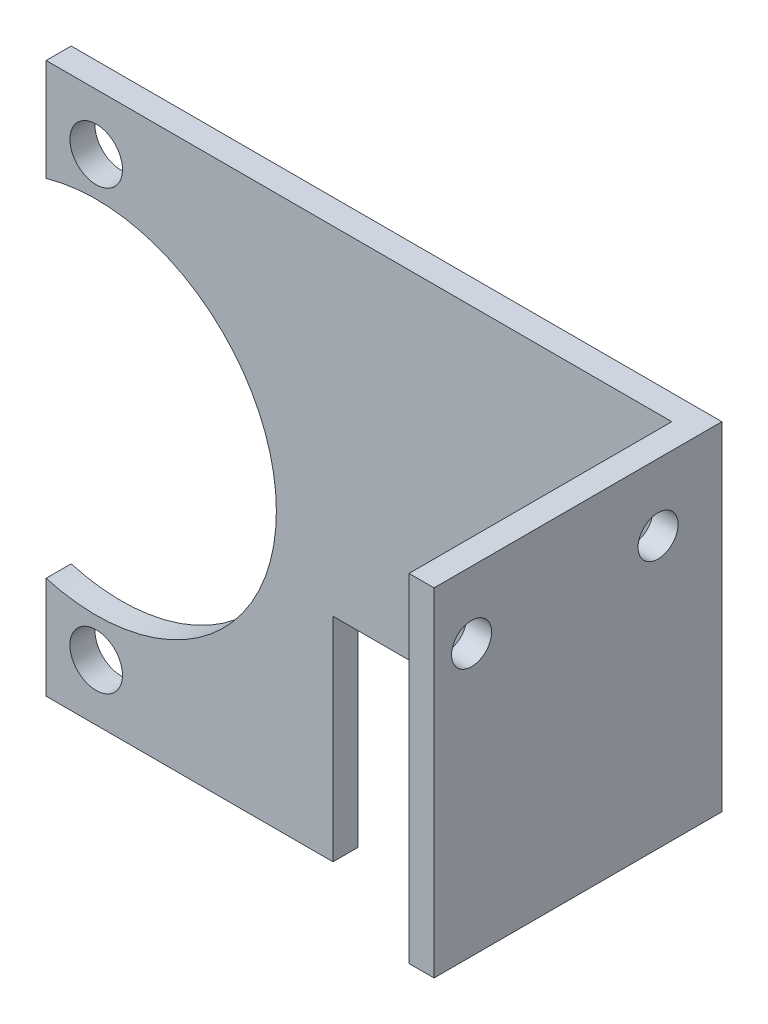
ISO-10303-21;
HEADER;
FILE_DESCRIPTION(('STEP AP214'),'2;1');
FILE_NAME('part.step','',(''),(''),'','','');
FILE_SCHEMA(('AUTOMOTIVE_DESIGN { 1 0 10303 214 1 1 1 1 }'));
ENDSEC;
DATA;
#1=APPLICATION_CONTEXT('core data for automotive mechanical design processes');
#2=APPLICATION_PROTOCOL_DEFINITION('international standard','automotive_design',2000,#1);
#3=PRODUCT_CONTEXT('',#1,'mechanical');
#4=PRODUCT('Part','Part','',(#3));
#5=PRODUCT_RELATED_PRODUCT_CATEGORY('part','',(#4));
#6=PRODUCT_DEFINITION_FORMATION('','',#4);
#7=PRODUCT_DEFINITION_CONTEXT('part definition',#1,'design');
#8=PRODUCT_DEFINITION('design','',#6,#7);
#9=PRODUCT_DEFINITION_SHAPE('','',#8);
#10=(LENGTH_UNIT() NAMED_UNIT(*) SI_UNIT(.MILLI.,.METRE.));
#11=(NAMED_UNIT(*) PLANE_ANGLE_UNIT() SI_UNIT($,.RADIAN.));
#12=(NAMED_UNIT(*) SI_UNIT($,.STERADIAN.) SOLID_ANGLE_UNIT());
#13=UNCERTAINTY_MEASURE_WITH_UNIT(LENGTH_MEASURE(1.E-05),#10,'distance_accuracy_value','');
#14=(GEOMETRIC_REPRESENTATION_CONTEXT(3) GLOBAL_UNCERTAINTY_ASSIGNED_CONTEXT((#13)) GLOBAL_UNIT_ASSIGNED_CONTEXT((#10,
#11,#12)) REPRESENTATION_CONTEXT('',''));
#15=CARTESIAN_POINT('',(0.,0.,0.));
#16=DIRECTION('',(0.,0.,1.));
#17=DIRECTION('',(1.,0.,0.));
#18=AXIS2_PLACEMENT_3D('',#15,#16,#17);
#19=CARTESIAN_POINT('',(0.,0.,2.));
#20=DIRECTION('',(0.,0.,1.));
#21=DIRECTION('',(1.,0.,0.));
#22=AXIS2_PLACEMENT_3D('',#19,#20,#21);
#23=PLANE('',#22);
#24=CARTESIAN_POINT('',(-30.5,17.5,2.));
#25=DIRECTION('',(0.,0.,1.));
#26=DIRECTION('',(1.,0.,0.));
#27=AXIS2_PLACEMENT_3D('',#24,#25,#26);
#28=CIRCLE('',#27,2.1);
#29=CARTESIAN_POINT('',(-28.4,17.5,2.));
#30=VERTEX_POINT('',#29);
#31=EDGE_CURVE('E166',#30,#30,#28,.T.);
#32=ORIENTED_EDGE('',*,*,#31,.F.);
#33=EDGE_LOOP('',(#32));
#34=FACE_BOUND('',#33,.T.);
#35=CARTESIAN_POINT('',(-30.5,-17.5,2.));
#36=DIRECTION('',(0.,0.,1.));
#37=DIRECTION('',(1.,0.,0.));
#38=AXIS2_PLACEMENT_3D('',#35,#36,#37);
#39=CIRCLE('',#38,2.1);
#40=CARTESIAN_POINT('',(-28.4,-17.5,2.));
#41=VERTEX_POINT('',#40);
#42=EDGE_CURVE('E207',#41,#41,#39,.T.);
#43=ORIENTED_EDGE('',*,*,#42,.F.);
#44=EDGE_LOOP('',(#43));
#45=FACE_BOUND('',#44,.T.);
#46=DIRECTION('',(-1.,0.,0.));
#47=VECTOR('',#46,1.);
#48=CARTESIAN_POINT('',(0.,-5.,2.));
#49=LINE('',#48,#47);
#50=CARTESIAN_POINT('',(15.5,-5.,2.));
#51=VERTEX_POINT('',#50);
#52=CARTESIAN_POINT('',(-11.5776673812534,-5.,2.));
#53=VERTEX_POINT('',#52);
#54=EDGE_CURVE('E136',#51,#53,#49,.T.);
#55=ORIENTED_EDGE('',*,*,#54,.F.);
#56=DIRECTION('',(0.,1.,0.));
#57=VECTOR('',#56,1.);
#58=CARTESIAN_POINT('',(15.5,0.,2.));
#59=LINE('',#58,#57);
#60=CARTESIAN_POINT('',(15.5,22.,2.));
#61=VERTEX_POINT('',#60);
#62=EDGE_CURVE('E147',#51,#61,#59,.T.);
#63=ORIENTED_EDGE('',*,*,#62,.T.);
#64=DIRECTION('',(-1.,0.,0.));
#65=VECTOR('',#64,1.);
#66=CARTESIAN_POINT('',(0.,22.,2.));
#67=LINE('',#66,#65);
#68=CARTESIAN_POINT('',(-34.5,22.,2.));
#69=VERTEX_POINT('',#68);
#70=EDGE_CURVE('E61',#61,#69,#67,.T.);
#71=ORIENTED_EDGE('',*,*,#70,.T.);
#72=DIRECTION('',(0.,-1.,0.));
#73=VECTOR('',#72,1.);
#74=CARTESIAN_POINT('',(-34.5,0.,2.));
#75=LINE('',#74,#73);
#76=CARTESIAN_POINT('',(-34.5,13.8332931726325,2.));
#77=VERTEX_POINT('',#76);
#78=EDGE_CURVE('E210',#69,#77,#75,.T.);
#79=ORIENTED_EDGE('',*,*,#78,.T.);
#80=CARTESIAN_POINT('',(-30.5,0.,2.));
#81=DIRECTION('',(0.,0.,1.));
#82=DIRECTION('',(1.,0.,0.));
#83=AXIS2_PLACEMENT_3D('',#80,#81,#82);
#84=CIRCLE('',#83,14.4);
#85=CARTESIAN_POINT('',(-34.5,-13.8332931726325,2.));
#86=VERTEX_POINT('',#85);
#87=EDGE_CURVE('E101',#77,#86,#84,.F.);
#88=ORIENTED_EDGE('',*,*,#87,.T.);
#89=DIRECTION('',(0.,-1.,0.));
#90=VECTOR('',#89,1.);
#91=CARTESIAN_POINT('',(-34.5,0.,2.));
#92=LINE('',#91,#90);
#93=CARTESIAN_POINT('',(-34.5,-22.,2.));
#94=VERTEX_POINT('',#93);
#95=EDGE_CURVE('E117',#86,#94,#92,.T.);
#96=ORIENTED_EDGE('',*,*,#95,.T.);
#97=DIRECTION('',(1.,0.,0.));
#98=VECTOR('',#97,1.);
#99=CARTESIAN_POINT('',(0.,-22.,2.));
#100=LINE('',#99,#98);
#101=CARTESIAN_POINT('',(-11.5776673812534,-22.,2.));
#102=VERTEX_POINT('',#101);
#103=EDGE_CURVE('E111',#94,#102,#100,.T.);
#104=ORIENTED_EDGE('',*,*,#103,.T.);
#105=DIRECTION('',(0.,-1.,0.));
#106=VECTOR('',#105,1.);
#107=CARTESIAN_POINT('',(-11.5776673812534,0.,2.));
#108=LINE('',#107,#106);
#109=EDGE_CURVE('E115',#53,#102,#108,.T.);
#110=ORIENTED_EDGE('',*,*,#109,.F.);
#111=EDGE_LOOP('',(#55,#63,#71,#79,#88,#96,#104,#110));
#112=FACE_BOUND('',#111,.T.);
#113=ADVANCED_FACE('F35',(#34,#45,#112),#23,.T.);
#114=CARTESIAN_POINT('',(-34.5,0.,2.));
#115=DIRECTION('',(1.,0.,0.));
#116=DIRECTION('',(0.,0.,-1.));
#117=AXIS2_PLACEMENT_3D('',#114,#115,#116);
#118=PLANE('',#117);
#119=DIRECTION('',(0.,-1.,0.));
#120=VECTOR('',#119,1.);
#121=CARTESIAN_POINT('',(-34.5,0.,0.));
#122=LINE('',#121,#120);
#123=CARTESIAN_POINT('',(-34.5,22.,0.));
#124=VERTEX_POINT('',#123);
#125=CARTESIAN_POINT('',(-34.5,13.8332931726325,0.));
#126=VERTEX_POINT('',#125);
#127=EDGE_CURVE('E150',#124,#126,#122,.T.);
#128=ORIENTED_EDGE('',*,*,#127,.T.);
#129=DIRECTION('',(0.,0.,-1.));
#130=VECTOR('',#129,1.);
#131=CARTESIAN_POINT('',(-34.5,13.8332931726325,2.));
#132=LINE('',#131,#130);
#133=EDGE_CURVE('E11',#77,#126,#132,.T.);
#134=ORIENTED_EDGE('',*,*,#133,.F.);
#135=ORIENTED_EDGE('',*,*,#78,.F.);
#136=DIRECTION('',(0.,0.,-1.));
#137=VECTOR('',#136,1.);
#138=CARTESIAN_POINT('',(-34.5,22.,2.));
#139=LINE('',#138,#137);
#140=EDGE_CURVE('E142',#69,#124,#139,.T.);
#141=ORIENTED_EDGE('',*,*,#140,.T.);
#142=EDGE_LOOP('',(#128,#134,#135,#141));
#143=FACE_BOUND('',#142,.T.);
#144=ADVANCED_FACE('F233',(#143),#118,.F.);
#145=CARTESIAN_POINT('',(-30.5,0.,2.));
#146=DIRECTION('',(0.,0.,-1.));
#147=DIRECTION('',(-1.,0.,0.));
#148=AXIS2_PLACEMENT_3D('',#145,#146,#147);
#149=CYLINDRICAL_SURFACE('',#148,14.4);
#150=CARTESIAN_POINT('',(-30.5,0.,0.));
#151=DIRECTION('',(0.,0.,1.));
#152=DIRECTION('',(1.,0.,0.));
#153=AXIS2_PLACEMENT_3D('',#150,#151,#152);
#154=CIRCLE('',#153,14.4);
#155=CARTESIAN_POINT('',(-34.5,-13.8332931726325,0.));
#156=VERTEX_POINT('',#155);
#157=EDGE_CURVE('E153',#126,#156,#154,.F.);
#158=ORIENTED_EDGE('',*,*,#157,.T.);
#159=DIRECTION('',(0.,0.,-1.));
#160=VECTOR('',#159,1.);
#161=CARTESIAN_POINT('',(-34.5,-13.8332931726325,2.));
#162=LINE('',#161,#160);
#163=EDGE_CURVE('E44',#86,#156,#162,.T.);
#164=ORIENTED_EDGE('',*,*,#163,.F.);
#165=ORIENTED_EDGE('',*,*,#87,.F.);
#166=ORIENTED_EDGE('',*,*,#133,.T.);
#167=EDGE_LOOP('',(#158,#164,#165,#166));
#168=FACE_BOUND('',#167,.T.);
#169=ADVANCED_FACE('F214',(#168),#149,.F.);
#170=CARTESIAN_POINT('',(-34.5,0.,2.));
#171=DIRECTION('',(1.,0.,0.));
#172=DIRECTION('',(0.,0.,-1.));
#173=AXIS2_PLACEMENT_3D('',#170,#171,#172);
#174=PLANE('',#173);
#175=DIRECTION('',(0.,-1.,0.));
#176=VECTOR('',#175,1.);
#177=CARTESIAN_POINT('',(-34.5,0.,0.));
#178=LINE('',#177,#176);
#179=CARTESIAN_POINT('',(-34.5,-22.,0.));
#180=VERTEX_POINT('',#179);
#181=EDGE_CURVE('E155',#156,#180,#178,.T.);
#182=ORIENTED_EDGE('',*,*,#181,.T.);
#183=DIRECTION('',(0.,0.,-1.));
#184=VECTOR('',#183,1.);
#185=CARTESIAN_POINT('',(-34.5,-22.,2.));
#186=LINE('',#185,#184);
#187=EDGE_CURVE('E130',#94,#180,#186,.T.);
#188=ORIENTED_EDGE('',*,*,#187,.F.);
#189=ORIENTED_EDGE('',*,*,#95,.F.);
#190=ORIENTED_EDGE('',*,*,#163,.T.);
#191=EDGE_LOOP('',(#182,#188,#189,#190));
#192=FACE_BOUND('',#191,.T.);
#193=ADVANCED_FACE('F217',(#192),#174,.F.);
#194=CARTESIAN_POINT('',(0.,-22.,2.));
#195=DIRECTION('',(0.,1.,0.));
#196=DIRECTION('',(-1.,0.,0.));
#197=AXIS2_PLACEMENT_3D('',#194,#195,#196);
#198=PLANE('',#197);
#199=DIRECTION('',(1.,0.,0.));
#200=VECTOR('',#199,1.);
#201=CARTESIAN_POINT('',(0.,-22.,0.));
#202=LINE('',#201,#200);
#203=CARTESIAN_POINT('',(-11.5776673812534,-22.,0.));
#204=VERTEX_POINT('',#203);
#205=EDGE_CURVE('E126',#180,#204,#202,.T.);
#206=ORIENTED_EDGE('',*,*,#205,.T.);
#207=DIRECTION('',(0.,0.,-1.));
#208=VECTOR('',#207,1.);
#209=CARTESIAN_POINT('',(-11.5776673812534,-22.,2.));
#210=LINE('',#209,#208);
#211=EDGE_CURVE('E123',#102,#204,#210,.T.);
#212=ORIENTED_EDGE('',*,*,#211,.F.);
#213=ORIENTED_EDGE('',*,*,#103,.F.);
#214=ORIENTED_EDGE('',*,*,#187,.T.);
#215=EDGE_LOOP('',(#206,#212,#213,#214));
#216=FACE_BOUND('',#215,.T.);
#217=ADVANCED_FACE('F124',(#216),#198,.F.);
#218=CARTESIAN_POINT('',(-11.5776673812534,0.,2.));
#219=DIRECTION('',(1.,0.,0.));
#220=DIRECTION('',(0.,1.,0.));
#221=AXIS2_PLACEMENT_3D('',#218,#219,#220);
#222=PLANE('',#221);
#223=DIRECTION('',(0.,-1.,0.));
#224=VECTOR('',#223,1.);
#225=CARTESIAN_POINT('',(-11.5776673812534,0.,0.));
#226=LINE('',#225,#224);
#227=CARTESIAN_POINT('',(-11.5776673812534,-5.,0.));
#228=VERTEX_POINT('',#227);
#229=EDGE_CURVE('E158',#228,#204,#226,.T.);
#230=ORIENTED_EDGE('',*,*,#229,.F.);
#231=DIRECTION('',(0.,0.,-1.));
#232=VECTOR('',#231,1.);
#233=CARTESIAN_POINT('',(-11.5776673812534,-5.,2.));
#234=LINE('',#233,#232);
#235=EDGE_CURVE('E131',#53,#228,#234,.T.);
#236=ORIENTED_EDGE('',*,*,#235,.F.);
#237=ORIENTED_EDGE('',*,*,#109,.T.);
#238=ORIENTED_EDGE('',*,*,#211,.T.);
#239=EDGE_LOOP('',(#230,#236,#237,#238));
#240=FACE_BOUND('',#239,.T.);
#241=ADVANCED_FACE('F134',(#240),#222,.T.);
#242=CARTESIAN_POINT('',(0.,-5.,2.));
#243=DIRECTION('',(0.,-1.,0.));
#244=DIRECTION('',(1.,0.,0.));
#245=AXIS2_PLACEMENT_3D('',#242,#243,#244);
#246=PLANE('',#245);
#247=DIRECTION('',(0.,0.,-1.));
#248=VECTOR('',#247,1.);
#249=CARTESIAN_POINT('',(15.5,-5.,23.));
#250=LINE('',#249,#248);
#251=CARTESIAN_POINT('',(15.5,-5.,23.));
#252=VERTEX_POINT('',#251);
#253=EDGE_CURVE('E52',#252,#51,#250,.T.);
#254=ORIENTED_EDGE('',*,*,#253,.T.);
#255=ORIENTED_EDGE('',*,*,#54,.T.);
#256=ORIENTED_EDGE('',*,*,#235,.T.);
#257=DIRECTION('',(-1.,0.,0.));
#258=VECTOR('',#257,1.);
#259=CARTESIAN_POINT('',(0.,-5.,0.));
#260=LINE('',#259,#258);
#261=CARTESIAN_POINT('',(17.5,-5.,0.));
#262=VERTEX_POINT('',#261);
#263=EDGE_CURVE('E160',#262,#228,#260,.T.);
#264=ORIENTED_EDGE('',*,*,#263,.F.);
#265=DIRECTION('',(0.,0.,-1.));
#266=VECTOR('',#265,1.);
#267=CARTESIAN_POINT('',(17.5,-5.,2.));
#268=LINE('',#267,#266);
#269=CARTESIAN_POINT('',(17.5,-5.,23.));
#270=VERTEX_POINT('',#269);
#271=EDGE_CURVE('E170',#270,#262,#268,.T.);
#272=ORIENTED_EDGE('',*,*,#271,.F.);
#273=DIRECTION('',(1.,0.,0.));
#274=VECTOR('',#273,1.);
#275=CARTESIAN_POINT('',(0.,-5.,23.));
#276=LINE('',#275,#274);
#277=EDGE_CURVE('E197',#252,#270,#276,.T.);
#278=ORIENTED_EDGE('',*,*,#277,.F.);
#279=EDGE_LOOP('',(#254,#255,#256,#264,#272,#278));
#280=FACE_BOUND('',#279,.T.);
#281=ADVANCED_FACE('F224',(#280),#246,.T.);
#282=CARTESIAN_POINT('',(17.5,0.,2.));
#283=DIRECTION('',(1.,0.,0.));
#284=DIRECTION('',(0.,1.,0.));
#285=AXIS2_PLACEMENT_3D('',#282,#283,#284);
#286=PLANE('',#285);
#287=CARTESIAN_POINT('',(17.5,16.65,5.1));
#288=DIRECTION('',(1.,0.,0.));
#289=DIRECTION('',(0.,0.,-1.));
#290=AXIS2_PLACEMENT_3D('',#287,#288,#289);
#291=CIRCLE('',#290,1.6);
#292=CARTESIAN_POINT('',(17.5,16.65,3.5));
#293=VERTEX_POINT('',#292);
#294=EDGE_CURVE('E189',#293,#293,#291,.T.);
#295=ORIENTED_EDGE('',*,*,#294,.F.);
#296=EDGE_LOOP('',(#295));
#297=FACE_BOUND('',#296,.T.);
#298=CARTESIAN_POINT('',(17.5,16.65,20.));
#299=DIRECTION('',(1.,0.,0.));
#300=DIRECTION('',(0.,0.,-1.));
#301=AXIS2_PLACEMENT_3D('',#298,#299,#300);
#302=CIRCLE('',#301,1.6);
#303=CARTESIAN_POINT('',(17.5,16.65,18.4));
#304=VERTEX_POINT('',#303);
#305=EDGE_CURVE('E178',#304,#304,#302,.T.);
#306=ORIENTED_EDGE('',*,*,#305,.F.);
#307=EDGE_LOOP('',(#306));
#308=FACE_BOUND('',#307,.T.);
#309=DIRECTION('',(0.,-1.,0.));
#310=VECTOR('',#309,1.);
#311=CARTESIAN_POINT('',(17.5,0.,0.));
#312=LINE('',#311,#310);
#313=CARTESIAN_POINT('',(17.5,22.,0.));
#314=VERTEX_POINT('',#313);
#315=EDGE_CURVE('E162',#314,#262,#312,.T.);
#316=ORIENTED_EDGE('',*,*,#315,.F.);
#317=DIRECTION('',(0.,0.,-1.));
#318=VECTOR('',#317,1.);
#319=CARTESIAN_POINT('',(17.5,22.,2.));
#320=LINE('',#319,#318);
#321=CARTESIAN_POINT('',(17.5,22.,23.));
#322=VERTEX_POINT('',#321);
#323=EDGE_CURVE('E168',#322,#314,#320,.T.);
#324=ORIENTED_EDGE('',*,*,#323,.F.);
#325=DIRECTION('',(0.,-1.,0.));
#326=VECTOR('',#325,1.);
#327=CARTESIAN_POINT('',(17.5,0.,23.));
#328=LINE('',#327,#326);
#329=EDGE_CURVE('E177',#322,#270,#328,.T.);
#330=ORIENTED_EDGE('',*,*,#329,.T.);
#331=ORIENTED_EDGE('',*,*,#271,.T.);
#332=EDGE_LOOP('',(#316,#324,#330,#331));
#333=FACE_BOUND('',#332,.T.);
#334=ADVANCED_FACE('F236',(#297,#308,#333),#286,.T.);
#335=CARTESIAN_POINT('',(-30.5,-17.5,2.));
#336=DIRECTION('',(0.,0.,-1.));
#337=DIRECTION('',(-1.,0.,0.));
#338=AXIS2_PLACEMENT_3D('',#335,#336,#337);
#339=CYLINDRICAL_SURFACE('',#338,2.1);
#340=ORIENTED_EDGE('',*,*,#42,.T.);
#341=EDGE_LOOP('',(#340));
#342=FACE_BOUND('',#341,.T.);
#343=CARTESIAN_POINT('',(-30.5,-17.5,0.));
#344=DIRECTION('',(0.,0.,1.));
#345=DIRECTION('',(1.,0.,0.));
#346=AXIS2_PLACEMENT_3D('',#343,#344,#345);
#347=CIRCLE('',#346,2.1);
#348=CARTESIAN_POINT('',(-28.4,-17.5,0.));
#349=VERTEX_POINT('',#348);
#350=EDGE_CURVE('E146',#349,#349,#347,.T.);
#351=ORIENTED_EDGE('',*,*,#350,.F.);
#352=EDGE_LOOP('',(#351));
#353=FACE_BOUND('',#352,.T.);
#354=ADVANCED_FACE('F271',(#342,#353),#339,.F.);
#355=CARTESIAN_POINT('',(-30.5,17.5,2.));
#356=DIRECTION('',(0.,0.,-1.));
#357=DIRECTION('',(-1.,0.,0.));
#358=AXIS2_PLACEMENT_3D('',#355,#356,#357);
#359=CYLINDRICAL_SURFACE('',#358,2.1);
#360=ORIENTED_EDGE('',*,*,#31,.T.);
#361=EDGE_LOOP('',(#360));
#362=FACE_BOUND('',#361,.T.);
#363=CARTESIAN_POINT('',(-30.5,17.5,0.));
#364=DIRECTION('',(0.,0.,1.));
#365=DIRECTION('',(1.,0.,0.));
#366=AXIS2_PLACEMENT_3D('',#363,#364,#365);
#367=CIRCLE('',#366,2.1);
#368=CARTESIAN_POINT('',(-28.4,17.5,0.));
#369=VERTEX_POINT('',#368);
#370=EDGE_CURVE('E143',#369,#369,#367,.T.);
#371=ORIENTED_EDGE('',*,*,#370,.F.);
#372=EDGE_LOOP('',(#371));
#373=FACE_BOUND('',#372,.T.);
#374=ADVANCED_FACE('F37',(#362,#373),#359,.F.);
#375=CARTESIAN_POINT('',(0.,22.,2.));
#376=DIRECTION('',(0.,-1.,0.));
#377=DIRECTION('',(1.,0.,0.));
#378=AXIS2_PLACEMENT_3D('',#375,#376,#377);
#379=PLANE('',#378);
#380=DIRECTION('',(-1.,0.,0.));
#381=VECTOR('',#380,1.);
#382=CARTESIAN_POINT('',(0.,22.,0.));
#383=LINE('',#382,#381);
#384=EDGE_CURVE('E93',#314,#124,#383,.T.);
#385=ORIENTED_EDGE('',*,*,#384,.T.);
#386=ORIENTED_EDGE('',*,*,#140,.F.);
#387=ORIENTED_EDGE('',*,*,#70,.F.);
#388=DIRECTION('',(0.,0.,-1.));
#389=VECTOR('',#388,1.);
#390=CARTESIAN_POINT('',(15.5,22.,23.));
#391=LINE('',#390,#389);
#392=CARTESIAN_POINT('',(15.5,22.,23.));
#393=VERTEX_POINT('',#392);
#394=EDGE_CURVE('E201',#393,#61,#391,.T.);
#395=ORIENTED_EDGE('',*,*,#394,.F.);
#396=DIRECTION('',(1.,0.,0.));
#397=VECTOR('',#396,1.);
#398=CARTESIAN_POINT('',(0.,22.,23.));
#399=LINE('',#398,#397);
#400=EDGE_CURVE('E182',#393,#322,#399,.T.);
#401=ORIENTED_EDGE('',*,*,#400,.T.);
#402=ORIENTED_EDGE('',*,*,#323,.T.);
#403=EDGE_LOOP('',(#385,#386,#387,#395,#401,#402));
#404=FACE_BOUND('',#403,.T.);
#405=ADVANCED_FACE('F228',(#404),#379,.F.);
#406=CARTESIAN_POINT('',(0.,0.,0.));
#407=DIRECTION('',(0.,0.,1.));
#408=DIRECTION('',(1.,0.,0.));
#409=AXIS2_PLACEMENT_3D('',#406,#407,#408);
#410=PLANE('',#409);
#411=ORIENTED_EDGE('',*,*,#263,.T.);
#412=ORIENTED_EDGE('',*,*,#229,.T.);
#413=ORIENTED_EDGE('',*,*,#205,.F.);
#414=ORIENTED_EDGE('',*,*,#181,.F.);
#415=ORIENTED_EDGE('',*,*,#157,.F.);
#416=ORIENTED_EDGE('',*,*,#127,.F.);
#417=ORIENTED_EDGE('',*,*,#384,.F.);
#418=ORIENTED_EDGE('',*,*,#315,.T.);
#419=EDGE_LOOP('',(#411,#412,#413,#414,#415,#416,#417,#418));
#420=FACE_BOUND('',#419,.T.);
#421=ORIENTED_EDGE('',*,*,#350,.T.);
#422=EDGE_LOOP('',(#421));
#423=FACE_BOUND('',#422,.T.);
#424=ORIENTED_EDGE('',*,*,#370,.T.);
#425=EDGE_LOOP('',(#424));
#426=FACE_BOUND('',#425,.T.);
#427=ADVANCED_FACE('F219',(#420,#423,#426),#410,.F.);
#428=CARTESIAN_POINT('',(15.5,0.,23.));
#429=DIRECTION('',(1.,0.,0.));
#430=DIRECTION('',(0.,1.,0.));
#431=AXIS2_PLACEMENT_3D('',#428,#429,#430);
#432=PLANE('',#431);
#433=CARTESIAN_POINT('',(15.5,16.65,5.1));
#434=DIRECTION('',(1.,0.,0.));
#435=DIRECTION('',(0.,1.,0.));
#436=AXIS2_PLACEMENT_3D('',#433,#434,#435);
#437=CIRCLE('',#436,1.6);
#438=CARTESIAN_POINT('',(15.5,18.25,5.1));
#439=VERTEX_POINT('',#438);
#440=EDGE_CURVE('E39',#439,#439,#437,.F.);
#441=ORIENTED_EDGE('',*,*,#440,.F.);
#442=EDGE_LOOP('',(#441));
#443=FACE_BOUND('',#442,.T.);
#444=CARTESIAN_POINT('',(15.5,16.65,20.));
#445=DIRECTION('',(1.,0.,0.));
#446=DIRECTION('',(0.,1.,0.));
#447=AXIS2_PLACEMENT_3D('',#444,#445,#446);
#448=CIRCLE('',#447,1.6);
#449=CARTESIAN_POINT('',(15.5,18.25,20.));
#450=VERTEX_POINT('',#449);
#451=EDGE_CURVE('E175',#450,#450,#448,.F.);
#452=ORIENTED_EDGE('',*,*,#451,.F.);
#453=EDGE_LOOP('',(#452));
#454=FACE_BOUND('',#453,.T.);
#455=ORIENTED_EDGE('',*,*,#62,.F.);
#456=ORIENTED_EDGE('',*,*,#253,.F.);
#457=DIRECTION('',(0.,-1.,0.));
#458=VECTOR('',#457,1.);
#459=CARTESIAN_POINT('',(15.5,0.,23.));
#460=LINE('',#459,#458);
#461=EDGE_CURVE('E194',#393,#252,#460,.T.);
#462=ORIENTED_EDGE('',*,*,#461,.F.);
#463=ORIENTED_EDGE('',*,*,#394,.T.);
#464=EDGE_LOOP('',(#455,#456,#462,#463));
#465=FACE_BOUND('',#464,.T.);
#466=ADVANCED_FACE('F244',(#443,#454,#465),#432,.F.);
#467=CARTESIAN_POINT('',(0.,0.,23.));
#468=DIRECTION('',(0.,0.,1.));
#469=DIRECTION('',(1.,0.,0.));
#470=AXIS2_PLACEMENT_3D('',#467,#468,#469);
#471=PLANE('',#470);
#472=ORIENTED_EDGE('',*,*,#329,.F.);
#473=ORIENTED_EDGE('',*,*,#400,.F.);
#474=ORIENTED_EDGE('',*,*,#461,.T.);
#475=ORIENTED_EDGE('',*,*,#277,.T.);
#476=EDGE_LOOP('',(#472,#473,#474,#475));
#477=FACE_BOUND('',#476,.T.);
#478=ADVANCED_FACE('F241',(#477),#471,.T.);
#479=CARTESIAN_POINT('',(17.5,16.65,20.));
#480=DIRECTION('',(-1.,0.,0.));
#481=DIRECTION('',(0.,0.,1.));
#482=AXIS2_PLACEMENT_3D('',#479,#480,#481);
#483=CYLINDRICAL_SURFACE('',#482,1.6);
#484=ORIENTED_EDGE('',*,*,#305,.T.);
#485=EDGE_LOOP('',(#484));
#486=FACE_BOUND('',#485,.T.);
#487=ORIENTED_EDGE('',*,*,#451,.T.);
#488=EDGE_LOOP('',(#487));
#489=FACE_BOUND('',#488,.T.);
#490=ADVANCED_FACE('F252',(#486,#489),#483,.F.);
#491=CARTESIAN_POINT('',(17.5,16.65,5.1));
#492=DIRECTION('',(-1.,0.,0.));
#493=DIRECTION('',(0.,0.,1.));
#494=AXIS2_PLACEMENT_3D('',#491,#492,#493);
#495=CYLINDRICAL_SURFACE('',#494,1.6);
#496=ORIENTED_EDGE('',*,*,#294,.T.);
#497=EDGE_LOOP('',(#496));
#498=FACE_BOUND('',#497,.T.);
#499=ORIENTED_EDGE('',*,*,#440,.T.);
#500=EDGE_LOOP('',(#499));
#501=FACE_BOUND('',#500,.T.);
#502=ADVANCED_FACE('F335',(#498,#501),#495,.F.);
#503=CLOSED_SHELL('',(#113,#144,#169,#193,#217,#241,#281,#334,#354,#374,#405,#427,#466,#478,
#490,#502));
#504=MANIFOLD_SOLID_BREP('B2',#503);
#505=ADVANCED_BREP_SHAPE_REPRESENTATION('',(#18,#504),#14);
#506=SHAPE_DEFINITION_REPRESENTATION(#9,#505);
ENDSEC;
END-ISO-10303-21;
